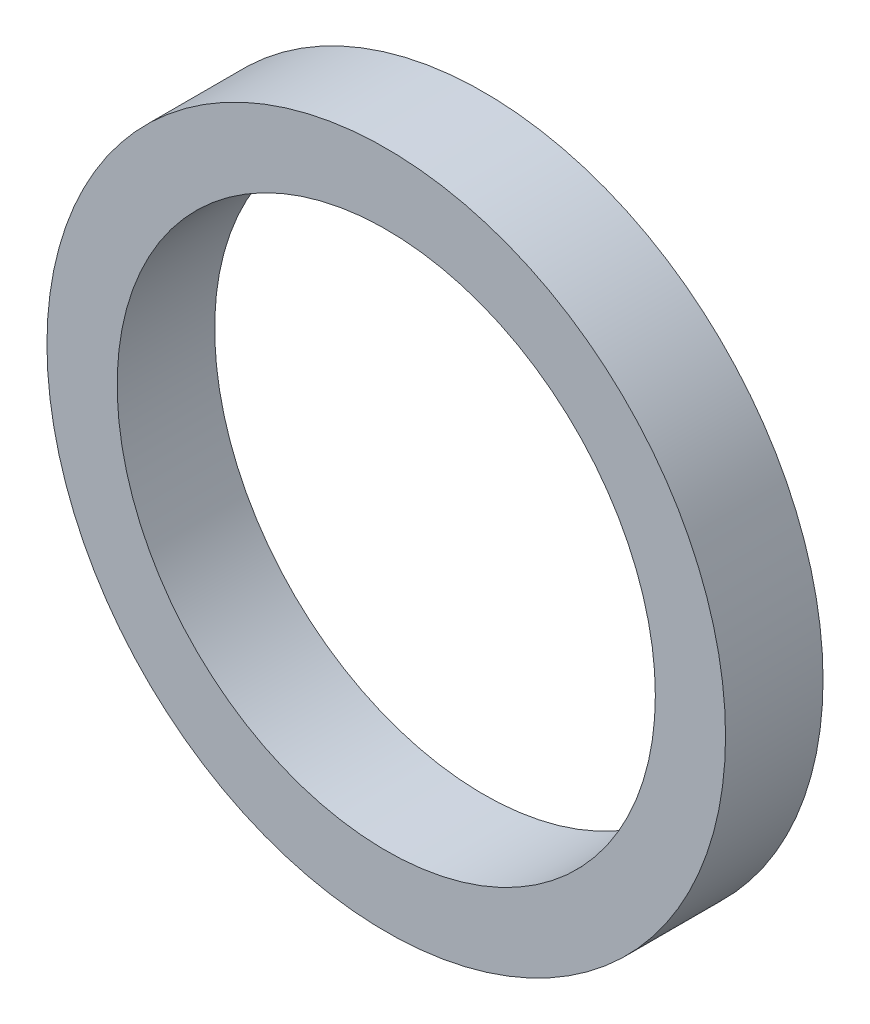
ISO-10303-21;
HEADER;
FILE_DESCRIPTION(('STEP AP214'),'2;1');
FILE_NAME('part.step','',(''),(''),'','','');
FILE_SCHEMA(('AUTOMOTIVE_DESIGN { 1 0 10303 214 1 1 1 1 }'));
ENDSEC;
DATA;
#1=APPLICATION_CONTEXT('core data for automotive mechanical design processes');
#2=APPLICATION_PROTOCOL_DEFINITION('international standard','automotive_design',2000,#1);
#3=PRODUCT_CONTEXT('',#1,'mechanical');
#4=PRODUCT('Part','Part','',(#3));
#5=PRODUCT_RELATED_PRODUCT_CATEGORY('part','',(#4));
#6=PRODUCT_DEFINITION_FORMATION('','',#4);
#7=PRODUCT_DEFINITION_CONTEXT('part definition',#1,'design');
#8=PRODUCT_DEFINITION('design','',#6,#7);
#9=PRODUCT_DEFINITION_SHAPE('','',#8);
#10=(LENGTH_UNIT() NAMED_UNIT(*) SI_UNIT(.MILLI.,.METRE.));
#11=(NAMED_UNIT(*) PLANE_ANGLE_UNIT() SI_UNIT($,.RADIAN.));
#12=(NAMED_UNIT(*) SI_UNIT($,.STERADIAN.) SOLID_ANGLE_UNIT());
#13=UNCERTAINTY_MEASURE_WITH_UNIT(LENGTH_MEASURE(1.E-05),#10,'distance_accuracy_value','');
#14=(GEOMETRIC_REPRESENTATION_CONTEXT(3) GLOBAL_UNCERTAINTY_ASSIGNED_CONTEXT((#13)) GLOBAL_UNIT_ASSIGNED_CONTEXT((#10,
#11,#12)) REPRESENTATION_CONTEXT('',''));
#15=CARTESIAN_POINT('',(0.,0.,0.));
#16=DIRECTION('',(0.,0.,1.));
#17=DIRECTION('',(1.,0.,0.));
#18=AXIS2_PLACEMENT_3D('',#15,#16,#17);
#19=CARTESIAN_POINT('',(0.,0.,3.17499999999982));
#20=DIRECTION('',(0.,0.,1.));
#21=DIRECTION('',(1.,0.,0.));
#22=AXIS2_PLACEMENT_3D('',#19,#20,#21);
#23=PLANE('',#22);
#24=CARTESIAN_POINT('',(0.,0.,3.17499999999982));
#25=DIRECTION('',(0.,0.,1.));
#26=DIRECTION('',(1.,0.,0.));
#27=AXIS2_PLACEMENT_3D('',#24,#25,#26);
#28=CIRCLE('',#27,11.049);
#29=CARTESIAN_POINT('',(11.049,0.,3.17499999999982));
#30=VERTEX_POINT('',#29);
#31=EDGE_CURVE('E10',#30,#30,#28,.T.);
#32=ORIENTED_EDGE('',*,*,#31,.T.);
#33=EDGE_LOOP('',(#32));
#34=FACE_BOUND('',#33,.T.);
#35=CARTESIAN_POINT('',(0.,0.,3.17499999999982));
#36=DIRECTION('',(0.,0.,1.));
#37=DIRECTION('',(1.,0.,0.));
#38=AXIS2_PLACEMENT_3D('',#35,#36,#37);
#39=CIRCLE('',#38,8.763);
#40=CARTESIAN_POINT('',(8.763,0.,3.17499999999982));
#41=VERTEX_POINT('',#40);
#42=EDGE_CURVE('E41',#41,#41,#39,.T.);
#43=ORIENTED_EDGE('',*,*,#42,.F.);
#44=EDGE_LOOP('',(#43));
#45=FACE_BOUND('',#44,.T.);
#46=ADVANCED_FACE('F30',(#34,#45),#23,.T.);
#47=CARTESIAN_POINT('',(0.,0.,-3.33066907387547E-13));
#48=DIRECTION('',(0.,0.,1.));
#49=DIRECTION('',(1.,0.,0.));
#50=AXIS2_PLACEMENT_3D('',#47,#48,#49);
#51=PLANE('',#50);
#52=CARTESIAN_POINT('',(0.,0.,-3.33066907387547E-13));
#53=DIRECTION('',(0.,0.,1.));
#54=DIRECTION('',(1.,0.,0.));
#55=AXIS2_PLACEMENT_3D('',#52,#53,#54);
#56=CIRCLE('',#55,11.049);
#57=CARTESIAN_POINT('',(11.049,0.,-3.33910253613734E-13));
#58=VERTEX_POINT('',#57);
#59=EDGE_CURVE('E37',#58,#58,#56,.T.);
#60=ORIENTED_EDGE('',*,*,#59,.F.);
#61=EDGE_LOOP('',(#60));
#62=FACE_BOUND('',#61,.T.);
#63=CARTESIAN_POINT('',(0.,0.,-3.33066907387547E-13));
#64=DIRECTION('',(0.,0.,1.));
#65=DIRECTION('',(1.,0.,0.));
#66=AXIS2_PLACEMENT_3D('',#63,#64,#65);
#67=CIRCLE('',#66,8.763);
#68=CARTESIAN_POINT('',(8.76299999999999,0.,-3.33735768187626E-13));
#69=VERTEX_POINT('',#68);
#70=EDGE_CURVE('E45',#69,#69,#67,.T.);
#71=ORIENTED_EDGE('',*,*,#70,.T.);
#72=EDGE_LOOP('',(#71));
#73=FACE_BOUND('',#72,.T.);
#74=ADVANCED_FACE('F51',(#62,#73),#51,.F.);
#75=CARTESIAN_POINT('',(0.,0.,3.17499999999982));
#76=DIRECTION('',(0.,0.,-1.));
#77=DIRECTION('',(-1.,0.,0.));
#78=AXIS2_PLACEMENT_3D('',#75,#76,#77);
#79=CYLINDRICAL_SURFACE('',#78,11.049);
#80=ORIENTED_EDGE('',*,*,#31,.F.);
#81=EDGE_LOOP('',(#80));
#82=FACE_BOUND('',#81,.T.);
#83=ORIENTED_EDGE('',*,*,#59,.T.);
#84=EDGE_LOOP('',(#83));
#85=FACE_BOUND('',#84,.T.);
#86=ADVANCED_FACE('F32',(#82,#85),#79,.T.);
#87=CARTESIAN_POINT('',(0.,0.,3.17499999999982));
#88=DIRECTION('',(0.,0.,-1.));
#89=DIRECTION('',(-1.,0.,0.));
#90=AXIS2_PLACEMENT_3D('',#87,#88,#89);
#91=CYLINDRICAL_SURFACE('',#90,8.763);
#92=ORIENTED_EDGE('',*,*,#42,.T.);
#93=EDGE_LOOP('',(#92));
#94=FACE_BOUND('',#93,.T.);
#95=ORIENTED_EDGE('',*,*,#70,.F.);
#96=EDGE_LOOP('',(#95));
#97=FACE_BOUND('',#96,.T.);
#98=ADVANCED_FACE('F53',(#94,#97),#91,.F.);
#99=CLOSED_SHELL('',(#46,#74,#86,#98));
#100=MANIFOLD_SOLID_BREP('B2',#99);
#101=ADVANCED_BREP_SHAPE_REPRESENTATION('',(#18,#100),#14);
#102=SHAPE_DEFINITION_REPRESENTATION(#9,#101);
ENDSEC;
END-ISO-10303-21;
